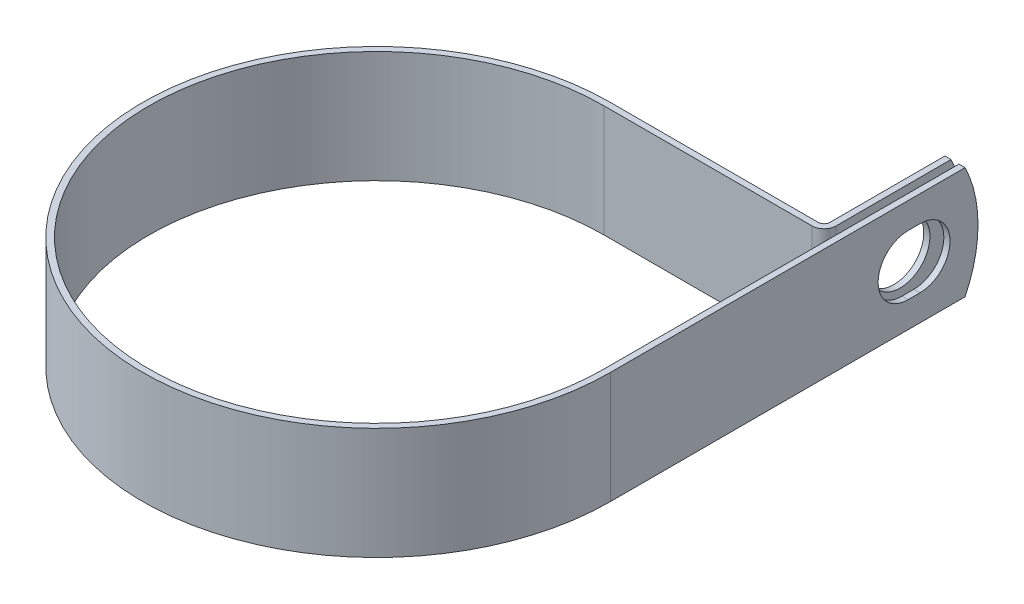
from build123d import *

# Parameters (mm, degrees)
EXTRUDE_THIN1_DEPTH = 11.1125
SKETCH2_R           = 5.9436
CUT_EXTRUDE1_DEPTH  = 1.2192
CUT_EXTRUDE2_REACH  = 120.697
CUT_EXTRUDE3_DEPTH  = 116.582646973


with BuildPart() as part:
    # Sketch1 → Extrude-Thin1 (new, symmetric)
    with BuildSketch(Plane(origin=(0, 0, 0), x_dir=(1, 0, 0), z_dir=(0, 1, 0))):
        with BuildLine():
            Line((45.2374, 73.025), (45.2374, 45.2374))
            Line((45.2374, 45.2374), (45.2374, 0))
            ThreePointArc((45.2374, 0), (-31.987672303, -31.987672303), (0, 45.2374))
            Line((0, 45.2374), (41.28516, 45.2374))
            ThreePointArc((41.28516, 45.2374), (42.966263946, 45.933736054), (43.6626, 47.61484))
            Line((43.6626, 47.61484), (43.6626, 73.025))
            Line((43.6626, 73.025), (42.4434, 73.025))
            Line((42.4434, 73.025), (42.4434, 47.61484))
            ThreePointArc((42.4434, 47.61484), (42.104159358, 46.795840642), (41.28516, 46.4566))
            Line((41.28516, 46.4566), (0, 46.4566))
            ThreePointArc((0, 46.4566), (-32.849776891, -32.849776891), (46.4566, 0))
            Line((46.4566, 0), (46.4566, 45.2374))
            Line((46.4566, 45.2374), (46.4566, 73.025))
            Line((46.4566, 73.025), (45.2374, 73.025))
        make_face()
    extrude(amount=EXTRUDE_THIN1_DEPTH, both=True)

    # Sketch2 → Cut-Extrude1 (cut)
    with BuildSketch(Plane.ZY.offset(-42.4434)):
        with Locations((-60.325, 0)):
            Circle(SKETCH2_R)
    extrude(amount=-CUT_EXTRUDE1_DEPTH, mode=Mode.SUBTRACT)

    # Sketch3 → Cut-Extrude2 (cut, up to next)
    with BuildSketch(Plane(origin=(46.4566, 0, 0), x_dir=(0, 0, -1), z_dir=(1, 0, 0)), mode=Mode.PRIVATE) as cut_extrude2_sk1:
        with BuildLine():
            Line((59.1312, 5.9436), (61.5188, 5.9436))
            ThreePointArc((61.5188, 5.9436), (67.4624, 0), (61.5188, -5.9436))
            Line((61.5188, -5.9436), (59.1312, -5.9436))
            ThreePointArc((59.1312, -5.9436), (53.1876, 0), (59.1312, 5.9436))
        make_face()
    cut_extrude2_tool1 = extrude(cut_extrude2_sk1.sketch, amount=-CUT_EXTRUDE2_REACH, mode=Mode.PRIVATE) & part.part
    add(cut_extrude2_tool1.solids().sort_by_distance((46.4566, 0, -60.325))[0], mode=Mode.SUBTRACT)

    # Sketch4 → Cut-Extrude3 (cut, through all)
    with BuildSketch(Plane.ZY.offset(-42.4434)):
        with BuildLine():
            Line((-70.46514763, 11.1125), (-73.025, 11.1125))
            Line((-73.025, 11.1125), (-73.025, 0))
            ThreePointArc((-73.025, 0), (-72.376765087, 5.701765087), (-70.46514763, 11.1125))
        make_face()
        with BuildLine():
            ThreePointArc((-70.46514763, -11.1125), (-72.376765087, -5.701765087), (-73.025, 0))
            Line((-73.025, 0), (-73.025, -11.1125))
            Line((-73.025, -11.1125), (-70.46514763, -11.1125))
        make_face()
    extrude(amount=-CUT_EXTRUDE3_DEPTH, mode=Mode.SUBTRACT)


solid = part.part
